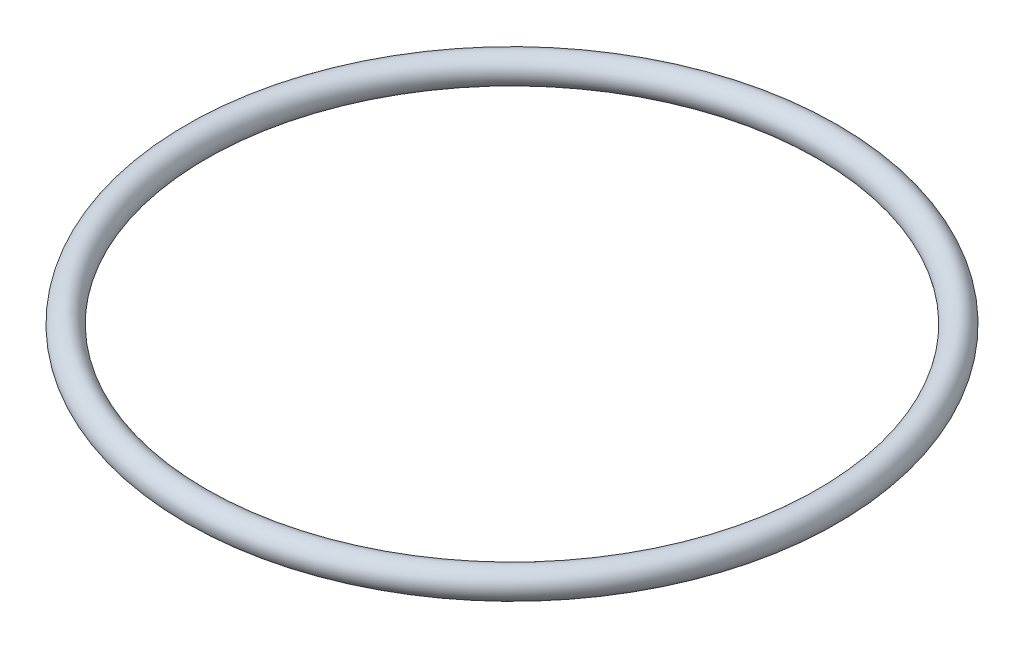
from build123d import *

# Parameters (mm, degrees)
ESQUISSE1_R = 3.495


with BuildPart() as part:
    # Esquisse1 → Base-R_volution (revolve)
    with BuildSketch(Plane.XY, mode=Mode.PRIVATE) as base_r_volution_sk:
        with Locations((-79.38, 3.495)):
            Circle(ESQUISSE1_R)
    revolve(base_r_volution_sk.sketch.rotate(Axis((0, 0, 0), (0, 1, 0)), 270), axis=Axis((0, 0, 0), (0, 1, 0)))


solid = part.part
